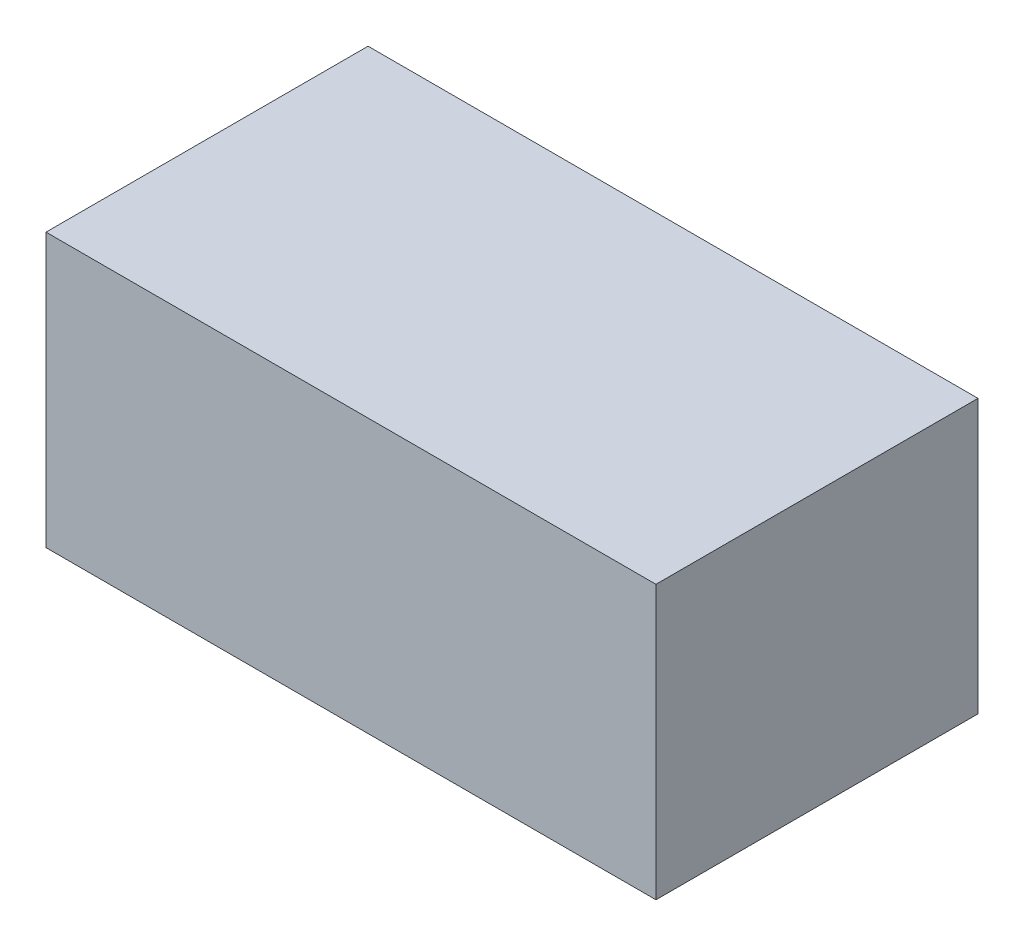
from build123d import *

# Parameters (mm, degrees)
SKETCH1_W           = 158.75
SKETCH1_H           = 83.82
BOSS_EXTRUDE1_DEPTH = 71.12


with BuildPart() as part:
    # Sketch1 → Boss-Extrude1 (new body)
    with BuildSketch(Plane(origin=(0, 0, 0), x_dir=(1, 0, 0), z_dir=(0, 1, 0))):
        with Locations((79.375, 41.91)):
            Rectangle(SKETCH1_W, SKETCH1_H)
    extrude(amount=BOSS_EXTRUDE1_DEPTH)


solid = part.part
